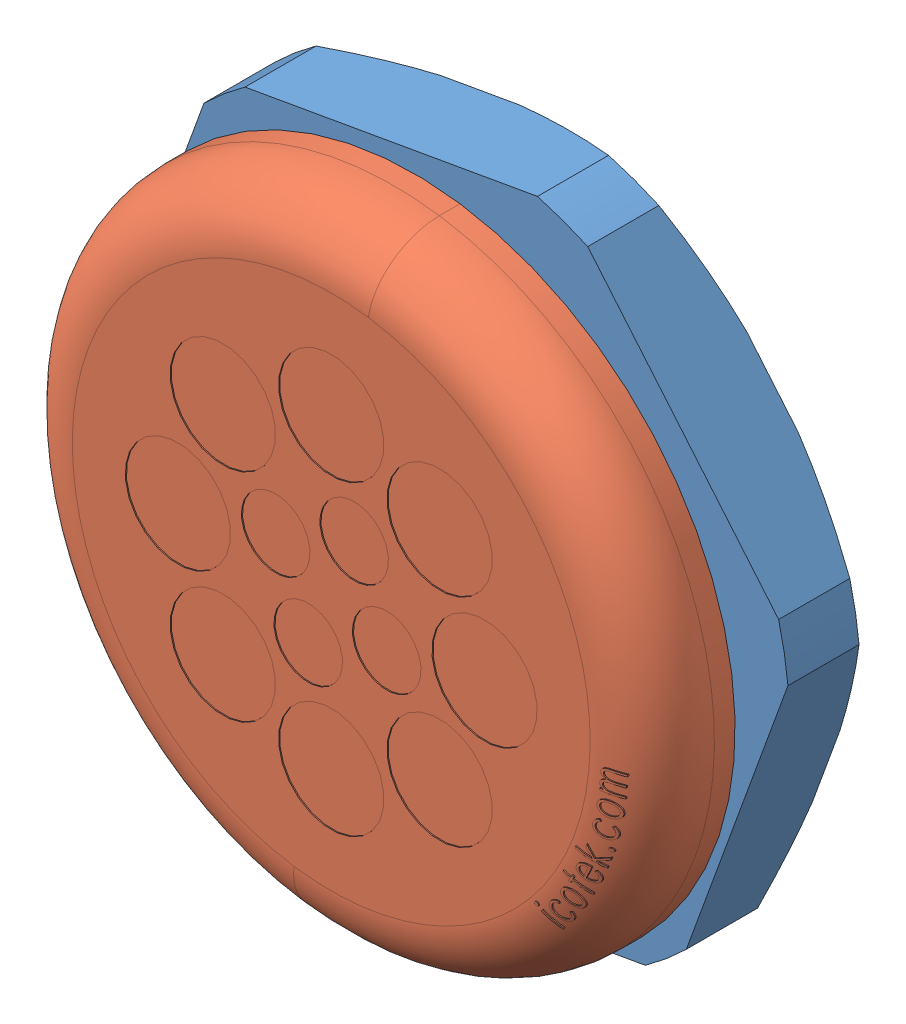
SolidWorks assembly 70357.SLDASM, configuration Default (file format 8000). Lengths in mm.
Overall size (71.79 71.06 22.1).
2 component instances, 2 part files, 0 mates.
Components (placement in the parent):
- 70357_01-1: 70357_01.SLDPRT [Default] at origin size (71.79 71.06 8.61)
- 70357_02-1: 70357_02.SLDPRT [Default] at origin size (62 62 22.1)
